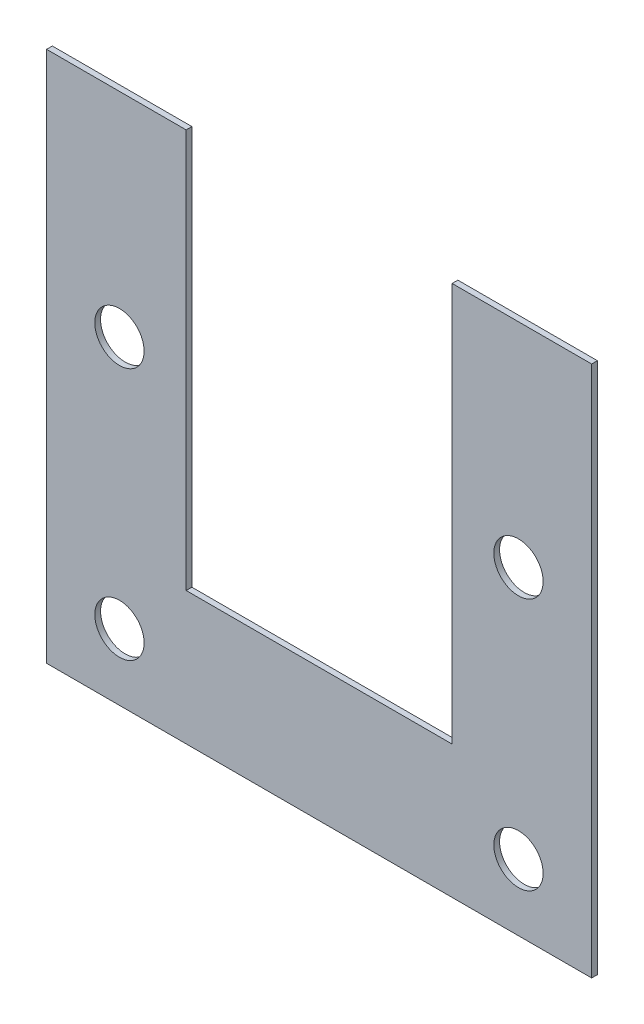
ISO-10303-21;
HEADER;
FILE_DESCRIPTION(('STEP AP214'),'2;1');
FILE_NAME('part.step','',(''),(''),'','','');
FILE_SCHEMA(('AUTOMOTIVE_DESIGN { 1 0 10303 214 1 1 1 1 }'));
ENDSEC;
DATA;
#1=APPLICATION_CONTEXT('core data for automotive mechanical design processes');
#2=APPLICATION_PROTOCOL_DEFINITION('international standard','automotive_design',2000,#1);
#3=PRODUCT_CONTEXT('',#1,'mechanical');
#4=PRODUCT('Part','Part','',(#3));
#5=PRODUCT_RELATED_PRODUCT_CATEGORY('part','',(#4));
#6=PRODUCT_DEFINITION_FORMATION('','',#4);
#7=PRODUCT_DEFINITION_CONTEXT('part definition',#1,'design');
#8=PRODUCT_DEFINITION('design','',#6,#7);
#9=PRODUCT_DEFINITION_SHAPE('','',#8);
#10=(LENGTH_UNIT() NAMED_UNIT(*) SI_UNIT(.MILLI.,.METRE.));
#11=(NAMED_UNIT(*) PLANE_ANGLE_UNIT() SI_UNIT($,.RADIAN.));
#12=(NAMED_UNIT(*) SI_UNIT($,.STERADIAN.) SOLID_ANGLE_UNIT());
#13=UNCERTAINTY_MEASURE_WITH_UNIT(LENGTH_MEASURE(1.E-05),#10,'distance_accuracy_value','');
#14=(GEOMETRIC_REPRESENTATION_CONTEXT(3) GLOBAL_UNCERTAINTY_ASSIGNED_CONTEXT((#13)) GLOBAL_UNIT_ASSIGNED_CONTEXT((#10,
#11,#12)) REPRESENTATION_CONTEXT('',''));
#15=CARTESIAN_POINT('',(0.,0.,0.));
#16=DIRECTION('',(0.,0.,1.));
#17=DIRECTION('',(1.,0.,0.));
#18=AXIS2_PLACEMENT_3D('',#15,#16,#17);
#19=CARTESIAN_POINT('',(-16.271875,16.271875,0.17145));
#20=DIRECTION('',(1.,0.,0.));
#21=DIRECTION('',(0.,1.,0.));
#22=AXIS2_PLACEMENT_3D('',#19,#20,#21);
#23=PLANE('',#22);
#24=DIRECTION('',(0.,-1.,0.));
#25=VECTOR('',#24,1.);
#26=CARTESIAN_POINT('',(-16.271875,16.271875,0.17145));
#27=LINE('',#26,#25);
#28=CARTESIAN_POINT('',(-16.271875,15.478125,0.17145));
#29=VERTEX_POINT('',#28);
#30=CARTESIAN_POINT('',(-16.271875,-16.271875,0.17145));
#31=VERTEX_POINT('',#30);
#32=EDGE_CURVE('E108',#29,#31,#27,.T.);
#33=ORIENTED_EDGE('',*,*,#32,.F.);
#34=DIRECTION('',(0.,0.,1.));
#35=VECTOR('',#34,1.);
#36=CARTESIAN_POINT('',(-16.271875,15.478125,-0.17145));
#37=LINE('',#36,#35);
#38=CARTESIAN_POINT('',(-16.271875,15.478125,-0.17145));
#39=VERTEX_POINT('',#38);
#40=EDGE_CURVE('E95',#39,#29,#37,.T.);
#41=ORIENTED_EDGE('',*,*,#40,.F.);
#42=DIRECTION('',(0.,-1.,0.));
#43=VECTOR('',#42,1.);
#44=CARTESIAN_POINT('',(-16.271875,16.271875,-0.17145));
#45=LINE('',#44,#43);
#46=CARTESIAN_POINT('',(-16.271875,-16.271875,-0.17145));
#47=VERTEX_POINT('',#46);
#48=EDGE_CURVE('E106',#39,#47,#45,.T.);
#49=ORIENTED_EDGE('',*,*,#48,.T.);
#50=DIRECTION('',(0.,0.,-1.));
#51=VECTOR('',#50,1.);
#52=CARTESIAN_POINT('',(-16.271875,-16.271875,0.17145));
#53=LINE('',#52,#51);
#54=EDGE_CURVE('E143',#31,#47,#53,.T.);
#55=ORIENTED_EDGE('',*,*,#54,.F.);
#56=EDGE_LOOP('',(#33,#41,#49,#55));
#57=FACE_BOUND('',#56,.T.);
#58=ADVANCED_FACE('F31',(#57),#23,.F.);
#59=CARTESIAN_POINT('',(-16.271875,-16.271875,0.17145));
#60=DIRECTION('',(0.,1.,0.));
#61=DIRECTION('',(0.,0.,1.));
#62=AXIS2_PLACEMENT_3D('',#59,#60,#61);
#63=PLANE('',#62);
#64=DIRECTION('',(1.,0.,0.));
#65=VECTOR('',#64,1.);
#66=CARTESIAN_POINT('',(-16.271875,-16.271875,-0.17145));
#67=LINE('',#66,#65);
#68=CARTESIAN_POINT('',(16.271875,-16.271875,-0.17145));
#69=VERTEX_POINT('',#68);
#70=EDGE_CURVE('E113',#47,#69,#67,.T.);
#71=ORIENTED_EDGE('',*,*,#70,.T.);
#72=DIRECTION('',(0.,0.,-1.));
#73=VECTOR('',#72,1.);
#74=CARTESIAN_POINT('',(16.271875,-16.271875,0.17145));
#75=LINE('',#74,#73);
#76=CARTESIAN_POINT('',(16.271875,-16.271875,0.17145));
#77=VERTEX_POINT('',#76);
#78=EDGE_CURVE('E140',#77,#69,#75,.T.);
#79=ORIENTED_EDGE('',*,*,#78,.F.);
#80=DIRECTION('',(1.,0.,0.));
#81=VECTOR('',#80,1.);
#82=CARTESIAN_POINT('',(-16.271875,-16.271875,0.17145));
#83=LINE('',#82,#81);
#84=EDGE_CURVE('E225',#31,#77,#83,.T.);
#85=ORIENTED_EDGE('',*,*,#84,.F.);
#86=ORIENTED_EDGE('',*,*,#54,.T.);
#87=EDGE_LOOP('',(#71,#79,#85,#86));
#88=FACE_BOUND('',#87,.T.);
#89=ADVANCED_FACE('F175',(#88),#63,.F.);
#90=CARTESIAN_POINT('',(16.271875,16.271875,0.17145));
#91=DIRECTION('',(-1.,0.,0.));
#92=DIRECTION('',(0.,-1.,0.));
#93=AXIS2_PLACEMENT_3D('',#90,#91,#92);
#94=PLANE('',#93);
#95=DIRECTION('',(0.,1.,0.));
#96=VECTOR('',#95,1.);
#97=CARTESIAN_POINT('',(16.271875,16.271875,-0.17145));
#98=LINE('',#97,#96);
#99=CARTESIAN_POINT('',(16.271875,15.478125,-0.17145));
#100=VERTEX_POINT('',#99);
#101=EDGE_CURVE('E117',#69,#100,#98,.T.);
#102=ORIENTED_EDGE('',*,*,#101,.T.);
#103=DIRECTION('',(0.,0.,1.));
#104=VECTOR('',#103,1.);
#105=CARTESIAN_POINT('',(16.271875,15.478125,-0.17145));
#106=LINE('',#105,#104);
#107=CARTESIAN_POINT('',(16.271875,15.478125,0.17145));
#108=VERTEX_POINT('',#107);
#109=EDGE_CURVE('E46',#100,#108,#106,.T.);
#110=ORIENTED_EDGE('',*,*,#109,.T.);
#111=DIRECTION('',(0.,1.,0.));
#112=VECTOR('',#111,1.);
#113=CARTESIAN_POINT('',(16.271875,16.271875,0.17145));
#114=LINE('',#113,#112);
#115=EDGE_CURVE('E222',#77,#108,#114,.T.);
#116=ORIENTED_EDGE('',*,*,#115,.F.);
#117=ORIENTED_EDGE('',*,*,#78,.T.);
#118=EDGE_LOOP('',(#102,#110,#116,#117));
#119=FACE_BOUND('',#118,.T.);
#120=ADVANCED_FACE('F180',(#119),#94,.F.);
#121=CARTESIAN_POINT('',(7.940675,16.271875,0.17145));
#122=DIRECTION('',(1.,0.,0.));
#123=DIRECTION('',(0.,1.,0.));
#124=AXIS2_PLACEMENT_3D('',#121,#122,#123);
#125=PLANE('',#124);
#126=DIRECTION('',(0.,-1.,0.));
#127=VECTOR('',#126,1.);
#128=CARTESIAN_POINT('',(7.940675,16.271875,0.17145));
#129=LINE('',#128,#127);
#130=CARTESIAN_POINT('',(7.940675,15.478125,0.17145));
#131=VERTEX_POINT('',#130);
#132=CARTESIAN_POINT('',(7.940675,-8.340725,0.17145));
#133=VERTEX_POINT('',#132);
#134=EDGE_CURVE('E227',#131,#133,#129,.T.);
#135=ORIENTED_EDGE('',*,*,#134,.F.);
#136=DIRECTION('',(0.,0.,-1.));
#137=VECTOR('',#136,1.);
#138=CARTESIAN_POINT('',(7.940675,15.478125,0.17145));
#139=LINE('',#138,#137);
#140=CARTESIAN_POINT('',(7.940675,15.478125,-0.17145));
#141=VERTEX_POINT('',#140);
#142=EDGE_CURVE('E216',#131,#141,#139,.T.);
#143=ORIENTED_EDGE('',*,*,#142,.T.);
#144=DIRECTION('',(0.,-1.,0.));
#145=VECTOR('',#144,1.);
#146=CARTESIAN_POINT('',(7.940675,16.271875,-0.17145));
#147=LINE('',#146,#145);
#148=CARTESIAN_POINT('',(7.940675,-8.340725,-0.17145));
#149=VERTEX_POINT('',#148);
#150=EDGE_CURVE('E128',#141,#149,#147,.T.);
#151=ORIENTED_EDGE('',*,*,#150,.T.);
#152=DIRECTION('',(0.,0.,-1.));
#153=VECTOR('',#152,1.);
#154=CARTESIAN_POINT('',(7.940675,-8.340725,0.17145));
#155=LINE('',#154,#153);
#156=EDGE_CURVE('E137',#133,#149,#155,.T.);
#157=ORIENTED_EDGE('',*,*,#156,.F.);
#158=EDGE_LOOP('',(#135,#143,#151,#157));
#159=FACE_BOUND('',#158,.T.);
#160=ADVANCED_FACE('F250',(#159),#125,.F.);
#161=CARTESIAN_POINT('',(-7.940675,-8.340725,0.17145));
#162=DIRECTION('',(0.,-1.,0.));
#163=DIRECTION('',(0.,0.,-1.));
#164=AXIS2_PLACEMENT_3D('',#161,#162,#163);
#165=PLANE('',#164);
#166=DIRECTION('',(-1.,0.,0.));
#167=VECTOR('',#166,1.);
#168=CARTESIAN_POINT('',(-7.940675,-8.340725,-0.17145));
#169=LINE('',#168,#167);
#170=CARTESIAN_POINT('',(-7.940675,-8.340725,-0.17145));
#171=VERTEX_POINT('',#170);
#172=EDGE_CURVE('E130',#149,#171,#169,.T.);
#173=ORIENTED_EDGE('',*,*,#172,.T.);
#174=DIRECTION('',(0.,0.,-1.));
#175=VECTOR('',#174,1.);
#176=CARTESIAN_POINT('',(-7.940675,-8.340725,0.17145));
#177=LINE('',#176,#175);
#178=CARTESIAN_POINT('',(-7.940675,-8.340725,0.17145));
#179=VERTEX_POINT('',#178);
#180=EDGE_CURVE('E134',#179,#171,#177,.T.);
#181=ORIENTED_EDGE('',*,*,#180,.F.);
#182=DIRECTION('',(-1.,0.,0.));
#183=VECTOR('',#182,1.);
#184=CARTESIAN_POINT('',(-7.940675,-8.340725,0.17145));
#185=LINE('',#184,#183);
#186=EDGE_CURVE('E229',#133,#179,#185,.T.);
#187=ORIENTED_EDGE('',*,*,#186,.F.);
#188=ORIENTED_EDGE('',*,*,#156,.T.);
#189=EDGE_LOOP('',(#173,#181,#187,#188));
#190=FACE_BOUND('',#189,.T.);
#191=ADVANCED_FACE('F169',(#190),#165,.F.);
#192=CARTESIAN_POINT('',(-7.940675,16.271875,0.17145));
#193=DIRECTION('',(-1.,0.,0.));
#194=DIRECTION('',(0.,-1.,0.));
#195=AXIS2_PLACEMENT_3D('',#192,#193,#194);
#196=PLANE('',#195);
#197=DIRECTION('',(0.,1.,0.));
#198=VECTOR('',#197,1.);
#199=CARTESIAN_POINT('',(-7.940675,16.271875,-0.17145));
#200=LINE('',#199,#198);
#201=CARTESIAN_POINT('',(-7.940675,15.478125,-0.17145));
#202=VERTEX_POINT('',#201);
#203=EDGE_CURVE('E132',#171,#202,#200,.T.);
#204=ORIENTED_EDGE('',*,*,#203,.T.);
#205=DIRECTION('',(0.,0.,1.));
#206=VECTOR('',#205,1.);
#207=CARTESIAN_POINT('',(-7.940675,15.478125,0.17145));
#208=LINE('',#207,#206);
#209=CARTESIAN_POINT('',(-7.940675,15.478125,0.17145));
#210=VERTEX_POINT('',#209);
#211=EDGE_CURVE('E53',#202,#210,#208,.T.);
#212=ORIENTED_EDGE('',*,*,#211,.T.);
#213=DIRECTION('',(0.,1.,0.));
#214=VECTOR('',#213,1.);
#215=CARTESIAN_POINT('',(-7.940675,16.271875,0.17145));
#216=LINE('',#215,#214);
#217=EDGE_CURVE('E123',#179,#210,#216,.T.);
#218=ORIENTED_EDGE('',*,*,#217,.F.);
#219=ORIENTED_EDGE('',*,*,#180,.T.);
#220=EDGE_LOOP('',(#204,#212,#218,#219));
#221=FACE_BOUND('',#220,.T.);
#222=ADVANCED_FACE('F159',(#221),#196,.F.);
#223=CARTESIAN_POINT('',(-16.271875,-16.271875,0.17145));
#224=DIRECTION('',(0.,0.,1.));
#225=DIRECTION('',(1.,0.,0.));
#226=AXIS2_PLACEMENT_3D('',#223,#224,#225);
#227=PLANE('',#226);
#228=DIRECTION('',(1.,0.,0.));
#229=VECTOR('',#228,1.);
#230=CARTESIAN_POINT('',(-16.271875,15.478125,0.17145));
#231=LINE('',#230,#229);
#232=EDGE_CURVE('E101',#29,#210,#231,.T.);
#233=ORIENTED_EDGE('',*,*,#232,.F.);
#234=ORIENTED_EDGE('',*,*,#32,.T.);
#235=ORIENTED_EDGE('',*,*,#84,.T.);
#236=ORIENTED_EDGE('',*,*,#115,.T.);
#237=EDGE_CURVE('E214',#131,#108,#231,.T.);
#238=ORIENTED_EDGE('',*,*,#237,.F.);
#239=ORIENTED_EDGE('',*,*,#134,.T.);
#240=ORIENTED_EDGE('',*,*,#186,.T.);
#241=ORIENTED_EDGE('',*,*,#217,.T.);
#242=EDGE_LOOP('',(#233,#234,#235,#236,#238,#239,#240,#241));
#243=FACE_BOUND('',#242,.T.);
#244=CARTESIAN_POINT('',(-11.922125,-12.309475,0.171450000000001));
#245=DIRECTION('',(0.,0.,1.));
#246=DIRECTION('',(1.,0.,0.));
#247=AXIS2_PLACEMENT_3D('',#244,#245,#246);
#248=CIRCLE('',#247,1.47320000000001);
#249=CARTESIAN_POINT('',(-10.448925,-12.309475,0.171450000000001));
#250=VERTEX_POINT('',#249);
#251=EDGE_CURVE('E243',#250,#250,#248,.T.);
#252=ORIENTED_EDGE('',*,*,#251,.F.);
#253=EDGE_LOOP('',(#252));
#254=FACE_BOUND('',#253,.T.);
#255=CARTESIAN_POINT('',(11.903075,-12.309475,0.171450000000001));
#256=DIRECTION('',(0.,0.,1.));
#257=DIRECTION('',(1.,0.,0.));
#258=AXIS2_PLACEMENT_3D('',#255,#256,#257);
#259=CIRCLE('',#258,1.47320000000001);
#260=CARTESIAN_POINT('',(13.376275,-12.309475,0.171450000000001));
#261=VERTEX_POINT('',#260);
#262=EDGE_CURVE('E120',#261,#261,#259,.T.);
#263=ORIENTED_EDGE('',*,*,#262,.F.);
#264=EDGE_LOOP('',(#263));
#265=FACE_BOUND('',#264,.T.);
#266=CARTESIAN_POINT('',(11.903075,2.778125,0.171450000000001));
#267=DIRECTION('',(0.,0.,1.));
#268=DIRECTION('',(1.,0.,0.));
#269=AXIS2_PLACEMENT_3D('',#266,#267,#268);
#270=CIRCLE('',#269,1.47320000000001);
#271=CARTESIAN_POINT('',(13.376275,2.778125,0.171450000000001));
#272=VERTEX_POINT('',#271);
#273=EDGE_CURVE('E148',#272,#272,#270,.T.);
#274=ORIENTED_EDGE('',*,*,#273,.F.);
#275=EDGE_LOOP('',(#274));
#276=FACE_BOUND('',#275,.T.);
#277=CARTESIAN_POINT('',(-11.922125,2.778125,0.171450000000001));
#278=DIRECTION('',(0.,0.,1.));
#279=DIRECTION('',(1.,0.,0.));
#280=AXIS2_PLACEMENT_3D('',#277,#278,#279);
#281=CIRCLE('',#280,1.47320000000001);
#282=CARTESIAN_POINT('',(-10.448925,2.778125,0.171450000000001));
#283=VERTEX_POINT('',#282);
#284=EDGE_CURVE('E39',#283,#283,#281,.T.);
#285=ORIENTED_EDGE('',*,*,#284,.F.);
#286=EDGE_LOOP('',(#285));
#287=FACE_BOUND('',#286,.T.);
#288=ADVANCED_FACE('F157',(#243,#254,#265,#276,#287),#227,.T.);
#289=CARTESIAN_POINT('',(-16.271875,-16.271875,-0.17145));
#290=DIRECTION('',(0.,0.,1.));
#291=DIRECTION('',(1.,0.,0.));
#292=AXIS2_PLACEMENT_3D('',#289,#290,#291);
#293=PLANE('',#292);
#294=CARTESIAN_POINT('',(-11.922125,-12.309475,-0.17145));
#295=DIRECTION('',(0.,0.,1.));
#296=DIRECTION('',(1.,0.,0.));
#297=AXIS2_PLACEMENT_3D('',#294,#295,#296);
#298=CIRCLE('',#297,1.47320000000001);
#299=CARTESIAN_POINT('',(-10.448925,-12.309475,-0.17145));
#300=VERTEX_POINT('',#299);
#301=EDGE_CURVE('E238',#300,#300,#298,.T.);
#302=ORIENTED_EDGE('',*,*,#301,.T.);
#303=EDGE_LOOP('',(#302));
#304=FACE_BOUND('',#303,.T.);
#305=CARTESIAN_POINT('',(11.903075,-12.309475,-0.17145));
#306=DIRECTION('',(0.,0.,1.));
#307=DIRECTION('',(1.,0.,0.));
#308=AXIS2_PLACEMENT_3D('',#305,#306,#307);
#309=CIRCLE('',#308,1.47320000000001);
#310=CARTESIAN_POINT('',(13.376275,-12.309475,-0.17145));
#311=VERTEX_POINT('',#310);
#312=EDGE_CURVE('E115',#311,#311,#309,.T.);
#313=ORIENTED_EDGE('',*,*,#312,.T.);
#314=EDGE_LOOP('',(#313));
#315=FACE_BOUND('',#314,.T.);
#316=ORIENTED_EDGE('',*,*,#48,.F.);
#317=DIRECTION('',(1.,0.,0.));
#318=VECTOR('',#317,1.);
#319=CARTESIAN_POINT('',(-16.271875,15.478125,-0.17145));
#320=LINE('',#319,#318);
#321=EDGE_CURVE('E92',#39,#202,#320,.T.);
#322=ORIENTED_EDGE('',*,*,#321,.T.);
#323=ORIENTED_EDGE('',*,*,#203,.F.);
#324=ORIENTED_EDGE('',*,*,#172,.F.);
#325=ORIENTED_EDGE('',*,*,#150,.F.);
#326=DIRECTION('',(1.,0.,0.));
#327=VECTOR('',#326,1.);
#328=CARTESIAN_POINT('',(-16.271875,15.478125,-0.17145));
#329=LINE('',#328,#327);
#330=EDGE_CURVE('E11',#141,#100,#329,.T.);
#331=ORIENTED_EDGE('',*,*,#330,.T.);
#332=ORIENTED_EDGE('',*,*,#101,.F.);
#333=ORIENTED_EDGE('',*,*,#70,.F.);
#334=EDGE_LOOP('',(#316,#322,#323,#324,#325,#331,#332,#333));
#335=FACE_BOUND('',#334,.T.);
#336=CARTESIAN_POINT('',(11.903075,2.778125,-0.17145));
#337=DIRECTION('',(0.,0.,1.));
#338=DIRECTION('',(1.,0.,0.));
#339=AXIS2_PLACEMENT_3D('',#336,#337,#338);
#340=CIRCLE('',#339,1.47320000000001);
#341=CARTESIAN_POINT('',(13.376275,2.778125,-0.17145));
#342=VERTEX_POINT('',#341);
#343=EDGE_CURVE('E145',#342,#342,#340,.T.);
#344=ORIENTED_EDGE('',*,*,#343,.T.);
#345=EDGE_LOOP('',(#344));
#346=FACE_BOUND('',#345,.T.);
#347=CARTESIAN_POINT('',(-11.922125,2.778125,-0.17145));
#348=DIRECTION('',(0.,0.,1.));
#349=DIRECTION('',(1.,0.,0.));
#350=AXIS2_PLACEMENT_3D('',#347,#348,#349);
#351=CIRCLE('',#350,1.47320000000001);
#352=CARTESIAN_POINT('',(-10.448925,2.778125,-0.17145));
#353=VERTEX_POINT('',#352);
#354=EDGE_CURVE('E151',#353,#353,#351,.T.);
#355=ORIENTED_EDGE('',*,*,#354,.T.);
#356=EDGE_LOOP('',(#355));
#357=FACE_BOUND('',#356,.T.);
#358=ADVANCED_FACE('F110',(#304,#315,#335,#346,#357),#293,.F.);
#359=CARTESIAN_POINT('',(11.903075,-12.309475,0.17145));
#360=DIRECTION('',(0.,0.,1.));
#361=DIRECTION('',(1.,0.,0.));
#362=AXIS2_PLACEMENT_3D('',#359,#360,#361);
#363=CYLINDRICAL_SURFACE('',#362,1.47320000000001);
#364=ORIENTED_EDGE('',*,*,#312,.F.);
#365=EDGE_LOOP('',(#364));
#366=FACE_BOUND('',#365,.T.);
#367=ORIENTED_EDGE('',*,*,#262,.T.);
#368=EDGE_LOOP('',(#367));
#369=FACE_BOUND('',#368,.T.);
#370=ADVANCED_FACE('F166',(#366,#369),#363,.F.);
#371=CARTESIAN_POINT('',(-11.922125,-12.309475,0.17145));
#372=DIRECTION('',(0.,0.,1.));
#373=DIRECTION('',(1.,0.,0.));
#374=AXIS2_PLACEMENT_3D('',#371,#372,#373);
#375=CYLINDRICAL_SURFACE('',#374,1.47320000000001);
#376=ORIENTED_EDGE('',*,*,#301,.F.);
#377=EDGE_LOOP('',(#376));
#378=FACE_BOUND('',#377,.T.);
#379=ORIENTED_EDGE('',*,*,#251,.T.);
#380=EDGE_LOOP('',(#379));
#381=FACE_BOUND('',#380,.T.);
#382=ADVANCED_FACE('F186',(#378,#381),#375,.F.);
#383=CARTESIAN_POINT('',(11.903075,2.778125,0.17145));
#384=DIRECTION('',(0.,0.,1.));
#385=DIRECTION('',(1.,0.,0.));
#386=AXIS2_PLACEMENT_3D('',#383,#384,#385);
#387=CYLINDRICAL_SURFACE('',#386,1.47320000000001);
#388=ORIENTED_EDGE('',*,*,#343,.F.);
#389=EDGE_LOOP('',(#388));
#390=FACE_BOUND('',#389,.T.);
#391=ORIENTED_EDGE('',*,*,#273,.T.);
#392=EDGE_LOOP('',(#391));
#393=FACE_BOUND('',#392,.T.);
#394=ADVANCED_FACE('F184',(#390,#393),#387,.F.);
#395=CARTESIAN_POINT('',(-11.922125,2.778125,0.17145));
#396=DIRECTION('',(0.,0.,1.));
#397=DIRECTION('',(1.,0.,0.));
#398=AXIS2_PLACEMENT_3D('',#395,#396,#397);
#399=CYLINDRICAL_SURFACE('',#398,1.47320000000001);
#400=ORIENTED_EDGE('',*,*,#354,.F.);
#401=EDGE_LOOP('',(#400));
#402=FACE_BOUND('',#401,.T.);
#403=ORIENTED_EDGE('',*,*,#284,.T.);
#404=EDGE_LOOP('',(#403));
#405=FACE_BOUND('',#404,.T.);
#406=ADVANCED_FACE('F33',(#402,#405),#399,.F.);
#407=CARTESIAN_POINT('',(-16.271875,15.478125,-0.17145));
#408=DIRECTION('',(0.,-1.,0.));
#409=DIRECTION('',(0.,0.,-1.));
#410=AXIS2_PLACEMENT_3D('',#407,#408,#409);
#411=PLANE('',#410);
#412=ORIENTED_EDGE('',*,*,#237,.T.);
#413=ORIENTED_EDGE('',*,*,#109,.F.);
#414=ORIENTED_EDGE('',*,*,#330,.F.);
#415=ORIENTED_EDGE('',*,*,#142,.F.);
#416=EDGE_LOOP('',(#412,#413,#414,#415));
#417=FACE_BOUND('',#416,.T.);
#418=ADVANCED_FACE('F192',(#417),#411,.F.);
#419=ORIENTED_EDGE('',*,*,#321,.F.);
#420=ORIENTED_EDGE('',*,*,#40,.T.);
#421=ORIENTED_EDGE('',*,*,#232,.T.);
#422=ORIENTED_EDGE('',*,*,#211,.F.);
#423=EDGE_LOOP('',(#419,#420,#421,#422));
#424=FACE_BOUND('',#423,.T.);
#425=ADVANCED_FACE('F94',(#424),#411,.F.);
#426=CLOSED_SHELL('',(#58,#89,#120,#160,#191,#222,#288,#358,#370,#382,#394,#406,#418,#425));
#427=MANIFOLD_SOLID_BREP('B2',#426);
#428=ADVANCED_BREP_SHAPE_REPRESENTATION('',(#18,#427),#14);
#429=SHAPE_DEFINITION_REPRESENTATION(#9,#428);
ENDSEC;
END-ISO-10303-21;
